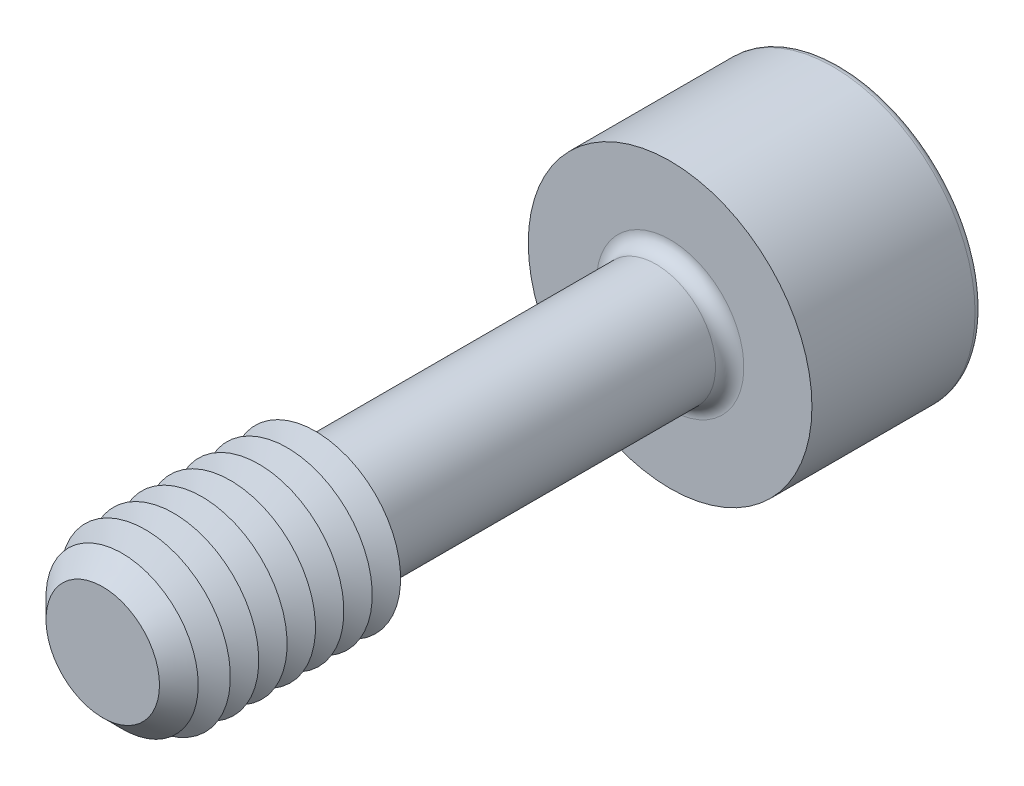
ISO-10303-21;
HEADER;
FILE_DESCRIPTION(('STEP AP214'),'2;1');
FILE_NAME('part.step','',(''),(''),'','','');
FILE_SCHEMA(('AUTOMOTIVE_DESIGN { 1 0 10303 214 1 1 1 1 }'));
ENDSEC;
DATA;
#1=APPLICATION_CONTEXT('core data for automotive mechanical design processes');
#2=APPLICATION_PROTOCOL_DEFINITION('international standard','automotive_design',2000,#1);
#3=PRODUCT_CONTEXT('',#1,'mechanical');
#4=PRODUCT('Part','Part','',(#3));
#5=PRODUCT_RELATED_PRODUCT_CATEGORY('part','',(#4));
#6=PRODUCT_DEFINITION_FORMATION('','',#4);
#7=PRODUCT_DEFINITION_CONTEXT('part definition',#1,'design');
#8=PRODUCT_DEFINITION('design','',#6,#7);
#9=PRODUCT_DEFINITION_SHAPE('','',#8);
#10=(LENGTH_UNIT() NAMED_UNIT(*) SI_UNIT(.MILLI.,.METRE.));
#11=(NAMED_UNIT(*) PLANE_ANGLE_UNIT() SI_UNIT($,.RADIAN.));
#12=(NAMED_UNIT(*) SI_UNIT($,.STERADIAN.) SOLID_ANGLE_UNIT());
#13=UNCERTAINTY_MEASURE_WITH_UNIT(LENGTH_MEASURE(1.E-05),#10,'distance_accuracy_value','');
#14=(GEOMETRIC_REPRESENTATION_CONTEXT(3) GLOBAL_UNCERTAINTY_ASSIGNED_CONTEXT((#13)) GLOBAL_UNIT_ASSIGNED_CONTEXT((#10,
#11,#12)) REPRESENTATION_CONTEXT('',''));
#15=CARTESIAN_POINT('',(0.,0.,0.));
#16=DIRECTION('',(0.,0.,1.));
#17=DIRECTION('',(1.,0.,0.));
#18=AXIS2_PLACEMENT_3D('',#15,#16,#17);
#19=CARTESIAN_POINT('',(-1.44337567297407,-2.5,-11.));
#20=DIRECTION('',(0.,0.,1.));
#21=DIRECTION('',(1.,0.,0.));
#22=AXIS2_PLACEMENT_3D('',#19,#20,#21);
#23=PLANE('',#22);
#24=DIRECTION('',(1.,0.,0.));
#25=VECTOR('',#24,1.);
#26=CARTESIAN_POINT('',(-1.44337567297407,-2.5,-11.));
#27=LINE('',#26,#25);
#28=CARTESIAN_POINT('',(0.,-2.5,-11.));
#29=VERTEX_POINT('',#28);
#30=CARTESIAN_POINT('',(1.44337567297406,-2.5,-11.));
#31=VERTEX_POINT('',#30);
#32=EDGE_CURVE('E729',#29,#31,#27,.T.);
#33=ORIENTED_EDGE('',*,*,#32,.F.);
#34=CARTESIAN_POINT('',(0.,0.,-11.));
#35=DIRECTION('',(0.,0.,1.));
#36=DIRECTION('',(0.,-1.,0.));
#37=AXIS2_PLACEMENT_3D('',#34,#35,#36);
#38=CIRCLE('',#37,2.5);
#39=CARTESIAN_POINT('',(2.1650635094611,-1.25,-11.));
#40=VERTEX_POINT('',#39);
#41=EDGE_CURVE('E53',#29,#40,#38,.T.);
#42=ORIENTED_EDGE('',*,*,#41,.T.);
#43=DIRECTION('',(0.5,0.866025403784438,0.));
#44=VECTOR('',#43,1.);
#45=CARTESIAN_POINT('',(1.44337567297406,-2.5,-11.));
#46=LINE('',#45,#44);
#47=EDGE_CURVE('E715',#31,#40,#46,.T.);
#48=ORIENTED_EDGE('',*,*,#47,.F.);
#49=EDGE_LOOP('',(#33,#42,#48));
#50=FACE_BOUND('',#49,.T.);
#51=ADVANCED_FACE('F41',(#50),#23,.F.);
#52=CARTESIAN_POINT('',(2.88675134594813,0.,-11.));
#53=VERTEX_POINT('',#52);
#54=EDGE_CURVE('E726',#40,#53,#46,.T.);
#55=ORIENTED_EDGE('',*,*,#54,.F.);
#56=CARTESIAN_POINT('',(2.1650635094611,1.25,-11.));
#57=VERTEX_POINT('',#56);
#58=EDGE_CURVE('E11',#40,#57,#38,.T.);
#59=ORIENTED_EDGE('',*,*,#58,.T.);
#60=DIRECTION('',(-0.5,0.866025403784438,0.));
#61=VECTOR('',#60,1.);
#62=CARTESIAN_POINT('',(2.88675134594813,0.,-11.));
#63=LINE('',#62,#61);
#64=EDGE_CURVE('E714',#53,#57,#63,.T.);
#65=ORIENTED_EDGE('',*,*,#64,.F.);
#66=EDGE_LOOP('',(#55,#59,#65));
#67=FACE_BOUND('',#66,.T.);
#68=ADVANCED_FACE('F133',(#67),#23,.F.);
#69=CARTESIAN_POINT('',(1.44337567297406,2.5,-11.));
#70=VERTEX_POINT('',#69);
#71=EDGE_CURVE('E709',#57,#70,#63,.T.);
#72=ORIENTED_EDGE('',*,*,#71,.F.);
#73=CARTESIAN_POINT('',(0.,2.5,-11.));
#74=VERTEX_POINT('',#73);
#75=EDGE_CURVE('E51',#57,#74,#38,.T.);
#76=ORIENTED_EDGE('',*,*,#75,.T.);
#77=DIRECTION('',(-1.,0.,0.));
#78=VECTOR('',#77,1.);
#79=CARTESIAN_POINT('',(1.44337567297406,2.5,-11.));
#80=LINE('',#79,#78);
#81=EDGE_CURVE('E177',#70,#74,#80,.T.);
#82=ORIENTED_EDGE('',*,*,#81,.F.);
#83=EDGE_LOOP('',(#72,#76,#82));
#84=FACE_BOUND('',#83,.T.);
#85=ADVANCED_FACE('F139',(#84),#23,.F.);
#86=CARTESIAN_POINT('',(-1.44337567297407,2.5,-11.));
#87=VERTEX_POINT('',#86);
#88=EDGE_CURVE('E720',#74,#87,#80,.T.);
#89=ORIENTED_EDGE('',*,*,#88,.F.);
#90=CARTESIAN_POINT('',(-2.1650635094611,1.25,-11.));
#91=VERTEX_POINT('',#90);
#92=EDGE_CURVE('E265',#74,#91,#38,.T.);
#93=ORIENTED_EDGE('',*,*,#92,.T.);
#94=DIRECTION('',(-0.5,-0.866025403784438,0.));
#95=VECTOR('',#94,1.);
#96=CARTESIAN_POINT('',(-1.44337567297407,2.5,-11.));
#97=LINE('',#96,#95);
#98=EDGE_CURVE('E176',#87,#91,#97,.T.);
#99=ORIENTED_EDGE('',*,*,#98,.F.);
#100=EDGE_LOOP('',(#89,#93,#99));
#101=FACE_BOUND('',#100,.T.);
#102=ADVANCED_FACE('F157',(#101),#23,.F.);
#103=CARTESIAN_POINT('',(-2.88675134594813,0.,-11.));
#104=VERTEX_POINT('',#103);
#105=EDGE_CURVE('E170',#91,#104,#97,.T.);
#106=ORIENTED_EDGE('',*,*,#105,.F.);
#107=CARTESIAN_POINT('',(-2.1650635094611,-1.25,-11.));
#108=VERTEX_POINT('',#107);
#109=EDGE_CURVE('E172',#91,#108,#38,.T.);
#110=ORIENTED_EDGE('',*,*,#109,.T.);
#111=DIRECTION('',(0.5,-0.866025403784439,0.));
#112=VECTOR('',#111,1.);
#113=CARTESIAN_POINT('',(-2.88675134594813,0.,-11.));
#114=LINE('',#113,#112);
#115=EDGE_CURVE('E174',#104,#108,#114,.T.);
#116=ORIENTED_EDGE('',*,*,#115,.F.);
#117=EDGE_LOOP('',(#106,#110,#116));
#118=FACE_BOUND('',#117,.T.);
#119=ADVANCED_FACE('F146',(#118),#23,.F.);
#120=CARTESIAN_POINT('',(0.,0.,-16.));
#121=DIRECTION('',(0.,0.,-1.));
#122=DIRECTION('',(-1.,0.,0.));
#123=AXIS2_PLACEMENT_3D('',#120,#121,#122);
#124=PLANE('',#123);
#125=CARTESIAN_POINT('',(0.,0.,-16.));
#126=DIRECTION('',(0.,0.,-1.));
#127=DIRECTION('',(-1.,0.,0.));
#128=AXIS2_PLACEMENT_3D('',#125,#126,#127);
#129=CIRCLE('',#128,4.75);
#130=CARTESIAN_POINT('',(-4.75,0.,-16.));
#131=VERTEX_POINT('',#130);
#132=EDGE_CURVE('E251',#131,#131,#129,.T.);
#133=ORIENTED_EDGE('',*,*,#132,.T.);
#134=EDGE_LOOP('',(#133));
#135=FACE_BOUND('',#134,.T.);
#136=DIRECTION('',(-0.5,-0.866025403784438,0.));
#137=VECTOR('',#136,1.);
#138=CARTESIAN_POINT('',(-1.44337567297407,2.5,-16.));
#139=LINE('',#138,#137);
#140=CARTESIAN_POINT('',(-1.44337567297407,2.5,-16.));
#141=VERTEX_POINT('',#140);
#142=CARTESIAN_POINT('',(-2.88675134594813,0.,-16.));
#143=VERTEX_POINT('',#142);
#144=EDGE_CURVE('E212',#141,#143,#139,.T.);
#145=ORIENTED_EDGE('',*,*,#144,.T.);
#146=DIRECTION('',(0.5,-0.866025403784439,0.));
#147=VECTOR('',#146,1.);
#148=CARTESIAN_POINT('',(-2.88675134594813,0.,-16.));
#149=LINE('',#148,#147);
#150=CARTESIAN_POINT('',(-1.44337567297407,-2.5,-16.));
#151=VERTEX_POINT('',#150);
#152=EDGE_CURVE('E67',#143,#151,#149,.T.);
#153=ORIENTED_EDGE('',*,*,#152,.T.);
#154=DIRECTION('',(1.,0.,0.));
#155=VECTOR('',#154,1.);
#156=CARTESIAN_POINT('',(-1.44337567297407,-2.5,-16.));
#157=LINE('',#156,#155);
#158=CARTESIAN_POINT('',(1.44337567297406,-2.5,-16.));
#159=VERTEX_POINT('',#158);
#160=EDGE_CURVE('E196',#151,#159,#157,.T.);
#161=ORIENTED_EDGE('',*,*,#160,.T.);
#162=DIRECTION('',(0.5,0.866025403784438,0.));
#163=VECTOR('',#162,1.);
#164=CARTESIAN_POINT('',(1.44337567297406,-2.5,-16.));
#165=LINE('',#164,#163);
#166=CARTESIAN_POINT('',(2.88675134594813,0.,-16.));
#167=VERTEX_POINT('',#166);
#168=EDGE_CURVE('E200',#159,#167,#165,.T.);
#169=ORIENTED_EDGE('',*,*,#168,.T.);
#170=DIRECTION('',(-0.5,0.866025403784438,0.));
#171=VECTOR('',#170,1.);
#172=CARTESIAN_POINT('',(2.88675134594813,0.,-16.));
#173=LINE('',#172,#171);
#174=CARTESIAN_POINT('',(1.44337567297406,2.5,-16.));
#175=VERTEX_POINT('',#174);
#176=EDGE_CURVE('E204',#167,#175,#173,.T.);
#177=ORIENTED_EDGE('',*,*,#176,.T.);
#178=DIRECTION('',(-1.,0.,0.));
#179=VECTOR('',#178,1.);
#180=CARTESIAN_POINT('',(1.44337567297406,2.5,-16.));
#181=LINE('',#180,#179);
#182=EDGE_CURVE('E208',#175,#141,#181,.T.);
#183=ORIENTED_EDGE('',*,*,#182,.T.);
#184=EDGE_LOOP('',(#145,#153,#161,#169,#177,#183));
#185=FACE_BOUND('',#184,.T.);
#186=ADVANCED_FACE('F156',(#135,#185),#124,.T.);
#187=CARTESIAN_POINT('',(0.,0.,10.));
#188=DIRECTION('',(0.,0.,-1.));
#189=DIRECTION('',(-1.,0.,0.));
#190=AXIS2_PLACEMENT_3D('',#187,#188,#189);
#191=CYLINDRICAL_SURFACE('',#190,2.1);
#192=CARTESIAN_POINT('',(0.,0.,-9.5));
#193=DIRECTION('',(0.,0.,-1.));
#194=DIRECTION('',(-1.,0.,0.));
#195=AXIS2_PLACEMENT_3D('',#192,#193,#194);
#196=CIRCLE('',#195,2.1);
#197=CARTESIAN_POINT('',(-2.1,0.,-9.5));
#198=VERTEX_POINT('',#197);
#199=EDGE_CURVE('E247',#198,#198,#196,.F.);
#200=ORIENTED_EDGE('',*,*,#199,.T.);
#201=EDGE_LOOP('',(#200));
#202=FACE_BOUND('',#201,.T.);
#203=CARTESIAN_POINT('',(0.,0.,1.98038475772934));
#204=DIRECTION('',(0.,0.,-1.));
#205=DIRECTION('',(0.,1.,0.));
#206=AXIS2_PLACEMENT_3D('',#203,#204,#205);
#207=CIRCLE('',#206,2.1);
#208=CARTESIAN_POINT('',(0.,2.1,1.98038475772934));
#209=VERTEX_POINT('',#208);
#210=EDGE_CURVE('E235',#209,#209,#207,.T.);
#211=ORIENTED_EDGE('',*,*,#210,.T.);
#212=EDGE_LOOP('',(#211));
#213=FACE_BOUND('',#212,.T.);
#214=ADVANCED_FACE('F163',(#202,#213),#191,.T.);
#215=CARTESIAN_POINT('',(0.,0.,1.98038475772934));
#216=DIRECTION('',(0.,0.,1.));
#217=DIRECTION('',(0.,-1.,0.));
#218=AXIS2_PLACEMENT_3D('',#215,#216,#217);
#219=CONICAL_SURFACE('',#218,2.1,1.0471975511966);
#220=CARTESIAN_POINT('',(0.,0.,2.5));
#221=DIRECTION('',(0.,0.,-1.));
#222=DIRECTION('',(-1.,0.,0.));
#223=AXIS2_PLACEMENT_3D('',#220,#221,#222);
#224=CIRCLE('',#223,3.);
#225=CARTESIAN_POINT('',(-3.,0.,2.5));
#226=VERTEX_POINT('',#225);
#227=EDGE_CURVE('E269',#226,#226,#224,.T.);
#228=ORIENTED_EDGE('',*,*,#227,.T.);
#229=EDGE_LOOP('',(#228));
#230=FACE_BOUND('',#229,.T.);
#231=ORIENTED_EDGE('',*,*,#210,.F.);
#232=EDGE_LOOP('',(#231));
#233=FACE_BOUND('',#232,.T.);
#234=ADVANCED_FACE('F486',(#230,#233),#219,.T.);
#235=CARTESIAN_POINT('',(0.,0.,-10.));
#236=DIRECTION('',(0.,0.,-1.));
#237=DIRECTION('',(-1.,0.,0.));
#238=AXIS2_PLACEMENT_3D('',#235,#236,#237);
#239=PLANE('',#238);
#240=CARTESIAN_POINT('',(0.,0.,-10.));
#241=DIRECTION('',(0.,0.,-1.));
#242=DIRECTION('',(-1.,0.,0.));
#243=AXIS2_PLACEMENT_3D('',#240,#241,#242);
#244=CIRCLE('',#243,2.6);
#245=CARTESIAN_POINT('',(-2.6,0.,-10.));
#246=VERTEX_POINT('',#245);
#247=EDGE_CURVE('E243',#246,#246,#244,.T.);
#248=ORIENTED_EDGE('',*,*,#247,.T.);
#249=EDGE_LOOP('',(#248));
#250=FACE_BOUND('',#249,.T.);
#251=CARTESIAN_POINT('',(0.,0.,-10.));
#252=DIRECTION('',(0.,0.,-1.));
#253=DIRECTION('',(-1.,0.,0.));
#254=AXIS2_PLACEMENT_3D('',#251,#252,#253);
#255=CIRCLE('',#254,5.);
#256=CARTESIAN_POINT('',(-5.,0.,-10.));
#257=VERTEX_POINT('',#256);
#258=EDGE_CURVE('E231',#257,#257,#255,.T.);
#259=ORIENTED_EDGE('',*,*,#258,.F.);
#260=EDGE_LOOP('',(#259));
#261=FACE_BOUND('',#260,.T.);
#262=ADVANCED_FACE('F479',(#250,#261),#239,.F.);
#263=CARTESIAN_POINT('',(0.,0.,-16.));
#264=DIRECTION('',(0.,0.,1.));
#265=DIRECTION('',(1.,0.,0.));
#266=AXIS2_PLACEMENT_3D('',#263,#264,#265);
#267=CYLINDRICAL_SURFACE('',#266,5.);
#268=CARTESIAN_POINT('',(0.,0.,-15.75));
#269=DIRECTION('',(0.,0.,-1.));
#270=DIRECTION('',(-1.,0.,0.));
#271=AXIS2_PLACEMENT_3D('',#268,#269,#270);
#272=CIRCLE('',#271,5.);
#273=CARTESIAN_POINT('',(-5.,0.,-15.75));
#274=VERTEX_POINT('',#273);
#275=EDGE_CURVE('E254',#274,#274,#272,.F.);
#276=ORIENTED_EDGE('',*,*,#275,.T.);
#277=EDGE_LOOP('',(#276));
#278=FACE_BOUND('',#277,.T.);
#279=ORIENTED_EDGE('',*,*,#258,.T.);
#280=EDGE_LOOP('',(#279));
#281=FACE_BOUND('',#280,.T.);
#282=ADVANCED_FACE('F485',(#278,#281),#267,.T.);
#283=CARTESIAN_POINT('',(-2.88675134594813,0.,-11.));
#284=DIRECTION('',(0.866025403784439,0.5,0.));
#285=DIRECTION('',(-0.5,0.866025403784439,0.));
#286=AXIS2_PLACEMENT_3D('',#283,#284,#285);
#287=PLANE('',#286);
#288=ORIENTED_EDGE('',*,*,#152,.F.);
#289=DIRECTION('',(0.,0.,-1.));
#290=VECTOR('',#289,1.);
#291=CARTESIAN_POINT('',(-2.88675134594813,0.,-11.));
#292=LINE('',#291,#290);
#293=EDGE_CURVE('E186',#104,#143,#292,.T.);
#294=ORIENTED_EDGE('',*,*,#293,.F.);
#295=ORIENTED_EDGE('',*,*,#115,.T.);
#296=CARTESIAN_POINT('',(-1.44337567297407,-2.5,-11.));
#297=VERTEX_POINT('',#296);
#298=EDGE_CURVE('E215',#108,#297,#114,.T.);
#299=ORIENTED_EDGE('',*,*,#298,.T.);
#300=DIRECTION('',(0.,0.,-1.));
#301=VECTOR('',#300,1.);
#302=CARTESIAN_POINT('',(-1.44337567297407,-2.5,-11.));
#303=LINE('',#302,#301);
#304=EDGE_CURVE('E228',#297,#151,#303,.T.);
#305=ORIENTED_EDGE('',*,*,#304,.T.);
#306=EDGE_LOOP('',(#288,#294,#295,#299,#305));
#307=FACE_BOUND('',#306,.T.);
#308=ADVANCED_FACE('F497',(#307),#287,.T.);
#309=CARTESIAN_POINT('',(-1.44337567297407,-2.5,-11.));
#310=DIRECTION('',(0.,1.,0.));
#311=DIRECTION('',(-1.,0.,0.));
#312=AXIS2_PLACEMENT_3D('',#309,#310,#311);
#313=PLANE('',#312);
#314=ORIENTED_EDGE('',*,*,#160,.F.);
#315=ORIENTED_EDGE('',*,*,#304,.F.);
#316=EDGE_CURVE('E727',#297,#29,#27,.T.);
#317=ORIENTED_EDGE('',*,*,#316,.T.);
#318=ORIENTED_EDGE('',*,*,#32,.T.);
#319=DIRECTION('',(0.,0.,-1.));
#320=VECTOR('',#319,1.);
#321=CARTESIAN_POINT('',(1.44337567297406,-2.5,-11.));
#322=LINE('',#321,#320);
#323=EDGE_CURVE('E225',#31,#159,#322,.T.);
#324=ORIENTED_EDGE('',*,*,#323,.T.);
#325=EDGE_LOOP('',(#314,#315,#317,#318,#324));
#326=FACE_BOUND('',#325,.T.);
#327=ADVANCED_FACE('F513',(#326),#313,.T.);
#328=CARTESIAN_POINT('',(1.44337567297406,-2.5,-11.));
#329=DIRECTION('',(-0.866025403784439,0.5,0.));
#330=DIRECTION('',(-0.5,-0.866025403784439,0.));
#331=AXIS2_PLACEMENT_3D('',#328,#329,#330);
#332=PLANE('',#331);
#333=ORIENTED_EDGE('',*,*,#168,.F.);
#334=ORIENTED_EDGE('',*,*,#323,.F.);
#335=ORIENTED_EDGE('',*,*,#47,.T.);
#336=ORIENTED_EDGE('',*,*,#54,.T.);
#337=DIRECTION('',(0.,0.,-1.));
#338=VECTOR('',#337,1.);
#339=CARTESIAN_POINT('',(2.88675134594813,0.,-11.));
#340=LINE('',#339,#338);
#341=EDGE_CURVE('E222',#53,#167,#340,.T.);
#342=ORIENTED_EDGE('',*,*,#341,.T.);
#343=EDGE_LOOP('',(#333,#334,#335,#336,#342));
#344=FACE_BOUND('',#343,.T.);
#345=ADVANCED_FACE('F523',(#344),#332,.T.);
#346=CARTESIAN_POINT('',(2.88675134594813,0.,-11.));
#347=DIRECTION('',(-0.866025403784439,-0.5,0.));
#348=DIRECTION('',(0.5,-0.866025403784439,0.));
#349=AXIS2_PLACEMENT_3D('',#346,#347,#348);
#350=PLANE('',#349);
#351=ORIENTED_EDGE('',*,*,#176,.F.);
#352=ORIENTED_EDGE('',*,*,#341,.F.);
#353=ORIENTED_EDGE('',*,*,#64,.T.);
#354=ORIENTED_EDGE('',*,*,#71,.T.);
#355=DIRECTION('',(0.,0.,-1.));
#356=VECTOR('',#355,1.);
#357=CARTESIAN_POINT('',(1.44337567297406,2.5,-11.));
#358=LINE('',#357,#356);
#359=EDGE_CURVE('E219',#70,#175,#358,.T.);
#360=ORIENTED_EDGE('',*,*,#359,.T.);
#361=EDGE_LOOP('',(#351,#352,#353,#354,#360));
#362=FACE_BOUND('',#361,.T.);
#363=ADVANCED_FACE('F533',(#362),#350,.T.);
#364=CARTESIAN_POINT('',(1.44337567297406,2.5,-11.));
#365=DIRECTION('',(0.,-1.,0.));
#366=DIRECTION('',(0.,0.,-1.));
#367=AXIS2_PLACEMENT_3D('',#364,#365,#366);
#368=PLANE('',#367);
#369=ORIENTED_EDGE('',*,*,#182,.F.);
#370=ORIENTED_EDGE('',*,*,#359,.F.);
#371=ORIENTED_EDGE('',*,*,#81,.T.);
#372=ORIENTED_EDGE('',*,*,#88,.T.);
#373=DIRECTION('',(0.,0.,-1.));
#374=VECTOR('',#373,1.);
#375=CARTESIAN_POINT('',(-1.44337567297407,2.5,-11.));
#376=LINE('',#375,#374);
#377=EDGE_CURVE('E182',#87,#141,#376,.T.);
#378=ORIENTED_EDGE('',*,*,#377,.T.);
#379=EDGE_LOOP('',(#369,#370,#371,#372,#378));
#380=FACE_BOUND('',#379,.T.);
#381=ADVANCED_FACE('F152',(#380),#368,.T.);
#382=CARTESIAN_POINT('',(-1.44337567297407,2.5,-11.));
#383=DIRECTION('',(0.866025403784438,-0.5,0.));
#384=DIRECTION('',(0.5,0.866025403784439,0.));
#385=AXIS2_PLACEMENT_3D('',#382,#383,#384);
#386=PLANE('',#385);
#387=ORIENTED_EDGE('',*,*,#144,.F.);
#388=ORIENTED_EDGE('',*,*,#377,.F.);
#389=ORIENTED_EDGE('',*,*,#98,.T.);
#390=ORIENTED_EDGE('',*,*,#105,.T.);
#391=ORIENTED_EDGE('',*,*,#293,.T.);
#392=EDGE_LOOP('',(#387,#388,#389,#390,#391));
#393=FACE_BOUND('',#392,.T.);
#394=ADVANCED_FACE('F144',(#393),#386,.T.);
#395=ORIENTED_EDGE('',*,*,#298,.F.);
#396=EDGE_CURVE('E257',#108,#29,#38,.T.);
#397=ORIENTED_EDGE('',*,*,#396,.T.);
#398=ORIENTED_EDGE('',*,*,#316,.F.);
#399=EDGE_LOOP('',(#395,#397,#398));
#400=FACE_BOUND('',#399,.T.);
#401=ADVANCED_FACE('F135',(#400),#23,.F.);
#402=CARTESIAN_POINT('',(0.,0.,-9.5));
#403=DIRECTION('',(0.,0.,-1.));
#404=DIRECTION('',(-1.,0.,0.));
#405=AXIS2_PLACEMENT_3D('',#402,#403,#404);
#406=TOROIDAL_SURFACE('',#405,2.6,0.5);
#407=ORIENTED_EDGE('',*,*,#199,.F.);
#408=EDGE_LOOP('',(#407));
#409=FACE_BOUND('',#408,.T.);
#410=ORIENTED_EDGE('',*,*,#247,.F.);
#411=EDGE_LOOP('',(#410));
#412=FACE_BOUND('',#411,.T.);
#413=ADVANCED_FACE('F129',(#409,#412),#406,.F.);
#414=CARTESIAN_POINT('',(0.,0.,-15.75));
#415=DIRECTION('',(0.,0.,-1.));
#416=DIRECTION('',(-1.,0.,0.));
#417=AXIS2_PLACEMENT_3D('',#414,#415,#416);
#418=TOROIDAL_SURFACE('',#417,4.75,0.25);
#419=ORIENTED_EDGE('',*,*,#275,.F.);
#420=EDGE_LOOP('',(#419));
#421=FACE_BOUND('',#420,.T.);
#422=ORIENTED_EDGE('',*,*,#132,.F.);
#423=EDGE_LOOP('',(#422));
#424=FACE_BOUND('',#423,.T.);
#425=ADVANCED_FACE('F43',(#421,#424),#418,.T.);
#426=CARTESIAN_POINT('',(0.,0.,-9.55662432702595));
#427=DIRECTION('',(0.,0.,-1.));
#428=DIRECTION('',(0.,1.,0.));
#429=AXIS2_PLACEMENT_3D('',#426,#427,#428);
#430=CONICAL_SURFACE('',#429,0.,1.0471975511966);
#431=ORIENTED_EDGE('',*,*,#41,.F.);
#432=ORIENTED_EDGE('',*,*,#396,.F.);
#433=ORIENTED_EDGE('',*,*,#109,.F.);
#434=ORIENTED_EDGE('',*,*,#92,.F.);
#435=ORIENTED_EDGE('',*,*,#75,.F.);
#436=ORIENTED_EDGE('',*,*,#58,.F.);
#437=EDGE_LOOP('',(#431,#432,#433,#434,#435,#436));
#438=FACE_BOUND('',#437,.T.);
#439=CARTESIAN_POINT('',(0.,0.,-9.55662432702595));
#440=VERTEX_POINT('',#439);
#441=VERTEX_LOOP('',#440);
#442=FACE_BOUND('',#441,.T.);
#443=ADVANCED_FACE('F118',(#438,#442),#430,.F.);
#444=CARTESIAN_POINT('',(0.,0.,3.));
#445=DIRECTION('',(0.,0.,-1.));
#446=DIRECTION('',(-1.,0.,0.));
#447=AXIS2_PLACEMENT_3D('',#444,#445,#446);
#448=CONICAL_SURFACE('',#447,2.13397459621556,1.0471975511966);
#449=ORIENTED_EDGE('',*,*,#227,.F.);
#450=EDGE_LOOP('',(#449));
#451=FACE_BOUND('',#450,.T.);
#452=CARTESIAN_POINT('',(0.,0.,3.));
#453=DIRECTION('',(0.,0.,-1.));
#454=DIRECTION('',(-1.,0.,0.));
#455=AXIS2_PLACEMENT_3D('',#452,#453,#454);
#456=CIRCLE('',#455,2.13397459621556);
#457=CARTESIAN_POINT('',(-2.13397459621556,0.,3.));
#458=VERTEX_POINT('',#457);
#459=EDGE_CURVE('E276',#458,#458,#456,.T.);
#460=ORIENTED_EDGE('',*,*,#459,.T.);
#461=EDGE_LOOP('',(#460));
#462=FACE_BOUND('',#461,.T.);
#463=ADVANCED_FACE('F120',(#451,#462),#448,.T.);
#464=CARTESIAN_POINT('',(0.,0.,3.5));
#465=DIRECTION('',(0.,0.,1.));
#466=DIRECTION('',(1.,0.,0.));
#467=AXIS2_PLACEMENT_3D('',#464,#465,#466);
#468=CONICAL_SURFACE('',#467,3.,1.0471975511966);
#469=ORIENTED_EDGE('',*,*,#459,.F.);
#470=EDGE_LOOP('',(#469));
#471=FACE_BOUND('',#470,.T.);
#472=CARTESIAN_POINT('',(0.,0.,3.5));
#473=DIRECTION('',(0.,0.,-1.));
#474=DIRECTION('',(-1.,0.,0.));
#475=AXIS2_PLACEMENT_3D('',#472,#473,#474);
#476=CIRCLE('',#475,3.);
#477=CARTESIAN_POINT('',(-3.,0.,3.5));
#478=VERTEX_POINT('',#477);
#479=EDGE_CURVE('E282',#478,#478,#476,.T.);
#480=ORIENTED_EDGE('',*,*,#479,.T.);
#481=EDGE_LOOP('',(#480));
#482=FACE_BOUND('',#481,.T.);
#483=ADVANCED_FACE('F126',(#471,#482),#468,.T.);
#484=CARTESIAN_POINT('',(0.,0.,4.));
#485=DIRECTION('',(0.,0.,-1.));
#486=DIRECTION('',(-1.,0.,0.));
#487=AXIS2_PLACEMENT_3D('',#484,#485,#486);
#488=CONICAL_SURFACE('',#487,2.13397459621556,1.0471975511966);
#489=ORIENTED_EDGE('',*,*,#479,.F.);
#490=EDGE_LOOP('',(#489));
#491=FACE_BOUND('',#490,.T.);
#492=CARTESIAN_POINT('',(0.,0.,4.));
#493=DIRECTION('',(0.,0.,-1.));
#494=DIRECTION('',(-1.,0.,0.));
#495=AXIS2_PLACEMENT_3D('',#492,#493,#494);
#496=CIRCLE('',#495,2.13397459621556);
#497=CARTESIAN_POINT('',(-2.13397459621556,0.,4.));
#498=VERTEX_POINT('',#497);
#499=EDGE_CURVE('E288',#498,#498,#496,.T.);
#500=ORIENTED_EDGE('',*,*,#499,.T.);
#501=EDGE_LOOP('',(#500));
#502=FACE_BOUND('',#501,.T.);
#503=ADVANCED_FACE('F383',(#491,#502),#488,.T.);
#504=CARTESIAN_POINT('',(0.,0.,4.5));
#505=DIRECTION('',(0.,0.,1.));
#506=DIRECTION('',(1.,0.,0.));
#507=AXIS2_PLACEMENT_3D('',#504,#505,#506);
#508=CONICAL_SURFACE('',#507,3.,1.0471975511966);
#509=ORIENTED_EDGE('',*,*,#499,.F.);
#510=EDGE_LOOP('',(#509));
#511=FACE_BOUND('',#510,.T.);
#512=CARTESIAN_POINT('',(0.,0.,4.5));
#513=DIRECTION('',(0.,0.,-1.));
#514=DIRECTION('',(-1.,0.,0.));
#515=AXIS2_PLACEMENT_3D('',#512,#513,#514);
#516=CIRCLE('',#515,3.);
#517=CARTESIAN_POINT('',(-3.,0.,4.5));
#518=VERTEX_POINT('',#517);
#519=EDGE_CURVE('E292',#518,#518,#516,.T.);
#520=ORIENTED_EDGE('',*,*,#519,.T.);
#521=EDGE_LOOP('',(#520));
#522=FACE_BOUND('',#521,.T.);
#523=ADVANCED_FACE('F379',(#511,#522),#508,.T.);
#524=CARTESIAN_POINT('',(0.,0.,5.));
#525=DIRECTION('',(0.,0.,-1.));
#526=DIRECTION('',(-1.,0.,0.));
#527=AXIS2_PLACEMENT_3D('',#524,#525,#526);
#528=CONICAL_SURFACE('',#527,2.13397459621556,1.0471975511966);
#529=ORIENTED_EDGE('',*,*,#519,.F.);
#530=EDGE_LOOP('',(#529));
#531=FACE_BOUND('',#530,.T.);
#532=CARTESIAN_POINT('',(0.,0.,5.));
#533=DIRECTION('',(0.,0.,-1.));
#534=DIRECTION('',(-1.,0.,0.));
#535=AXIS2_PLACEMENT_3D('',#532,#533,#534);
#536=CIRCLE('',#535,2.13397459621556);
#537=CARTESIAN_POINT('',(-2.13397459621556,0.,5.));
#538=VERTEX_POINT('',#537);
#539=EDGE_CURVE('E296',#538,#538,#536,.T.);
#540=ORIENTED_EDGE('',*,*,#539,.T.);
#541=EDGE_LOOP('',(#540));
#542=FACE_BOUND('',#541,.T.);
#543=ADVANCED_FACE('F375',(#531,#542),#528,.T.);
#544=CARTESIAN_POINT('',(0.,0.,5.5));
#545=DIRECTION('',(0.,0.,1.));
#546=DIRECTION('',(1.,0.,0.));
#547=AXIS2_PLACEMENT_3D('',#544,#545,#546);
#548=CONICAL_SURFACE('',#547,3.,1.0471975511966);
#549=ORIENTED_EDGE('',*,*,#539,.F.);
#550=EDGE_LOOP('',(#549));
#551=FACE_BOUND('',#550,.T.);
#552=CARTESIAN_POINT('',(0.,0.,5.5));
#553=DIRECTION('',(0.,0.,-1.));
#554=DIRECTION('',(-1.,0.,0.));
#555=AXIS2_PLACEMENT_3D('',#552,#553,#554);
#556=CIRCLE('',#555,3.);
#557=CARTESIAN_POINT('',(-3.,0.,5.5));
#558=VERTEX_POINT('',#557);
#559=EDGE_CURVE('E299',#558,#558,#556,.T.);
#560=ORIENTED_EDGE('',*,*,#559,.T.);
#561=EDGE_LOOP('',(#560));
#562=FACE_BOUND('',#561,.T.);
#563=ADVANCED_FACE('F371',(#551,#562),#548,.T.);
#564=CARTESIAN_POINT('',(0.,0.,6.));
#565=DIRECTION('',(0.,0.,-1.));
#566=DIRECTION('',(-1.,0.,0.));
#567=AXIS2_PLACEMENT_3D('',#564,#565,#566);
#568=CONICAL_SURFACE('',#567,2.13397459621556,1.0471975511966);
#569=ORIENTED_EDGE('',*,*,#559,.F.);
#570=EDGE_LOOP('',(#569));
#571=FACE_BOUND('',#570,.T.);
#572=CARTESIAN_POINT('',(0.,0.,6.));
#573=DIRECTION('',(0.,0.,-1.));
#574=DIRECTION('',(-1.,0.,0.));
#575=AXIS2_PLACEMENT_3D('',#572,#573,#574);
#576=CIRCLE('',#575,2.13397459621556);
#577=CARTESIAN_POINT('',(-2.13397459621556,0.,6.));
#578=VERTEX_POINT('',#577);
#579=EDGE_CURVE('E302',#578,#578,#576,.T.);
#580=ORIENTED_EDGE('',*,*,#579,.T.);
#581=EDGE_LOOP('',(#580));
#582=FACE_BOUND('',#581,.T.);
#583=ADVANCED_FACE('F367',(#571,#582),#568,.T.);
#584=CARTESIAN_POINT('',(0.,0.,6.5));
#585=DIRECTION('',(0.,0.,1.));
#586=DIRECTION('',(1.,0.,0.));
#587=AXIS2_PLACEMENT_3D('',#584,#585,#586);
#588=CONICAL_SURFACE('',#587,3.,1.0471975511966);
#589=ORIENTED_EDGE('',*,*,#579,.F.);
#590=EDGE_LOOP('',(#589));
#591=FACE_BOUND('',#590,.T.);
#592=CARTESIAN_POINT('',(0.,0.,6.5));
#593=DIRECTION('',(0.,0.,-1.));
#594=DIRECTION('',(-1.,0.,0.));
#595=AXIS2_PLACEMENT_3D('',#592,#593,#594);
#596=CIRCLE('',#595,3.);
#597=CARTESIAN_POINT('',(-3.,0.,6.5));
#598=VERTEX_POINT('',#597);
#599=EDGE_CURVE('E305',#598,#598,#596,.T.);
#600=ORIENTED_EDGE('',*,*,#599,.T.);
#601=EDGE_LOOP('',(#600));
#602=FACE_BOUND('',#601,.T.);
#603=ADVANCED_FACE('F363',(#591,#602),#588,.T.);
#604=CARTESIAN_POINT('',(0.,0.,7.));
#605=DIRECTION('',(0.,0.,-1.));
#606=DIRECTION('',(-1.,0.,0.));
#607=AXIS2_PLACEMENT_3D('',#604,#605,#606);
#608=CONICAL_SURFACE('',#607,2.13397459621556,1.0471975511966);
#609=ORIENTED_EDGE('',*,*,#599,.F.);
#610=EDGE_LOOP('',(#609));
#611=FACE_BOUND('',#610,.T.);
#612=CARTESIAN_POINT('',(0.,0.,7.));
#613=DIRECTION('',(0.,0.,-1.));
#614=DIRECTION('',(-1.,0.,0.));
#615=AXIS2_PLACEMENT_3D('',#612,#613,#614);
#616=CIRCLE('',#615,2.13397459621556);
#617=CARTESIAN_POINT('',(-2.13397459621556,0.,7.));
#618=VERTEX_POINT('',#617);
#619=EDGE_CURVE('E309',#618,#618,#616,.T.);
#620=ORIENTED_EDGE('',*,*,#619,.T.);
#621=EDGE_LOOP('',(#620));
#622=FACE_BOUND('',#621,.T.);
#623=ADVANCED_FACE('F359',(#611,#622),#608,.T.);
#624=CARTESIAN_POINT('',(0.,0.,7.5));
#625=DIRECTION('',(0.,0.,1.));
#626=DIRECTION('',(1.,0.,0.));
#627=AXIS2_PLACEMENT_3D('',#624,#625,#626);
#628=CONICAL_SURFACE('',#627,3.,1.0471975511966);
#629=ORIENTED_EDGE('',*,*,#619,.F.);
#630=EDGE_LOOP('',(#629));
#631=FACE_BOUND('',#630,.T.);
#632=CARTESIAN_POINT('',(0.,0.,7.5));
#633=DIRECTION('',(0.,0.,-1.));
#634=DIRECTION('',(-1.,0.,0.));
#635=AXIS2_PLACEMENT_3D('',#632,#633,#634);
#636=CIRCLE('',#635,3.);
#637=CARTESIAN_POINT('',(-3.,0.,7.5));
#638=VERTEX_POINT('',#637);
#639=EDGE_CURVE('E313',#638,#638,#636,.T.);
#640=ORIENTED_EDGE('',*,*,#639,.T.);
#641=EDGE_LOOP('',(#640));
#642=FACE_BOUND('',#641,.T.);
#643=ADVANCED_FACE('F355',(#631,#642),#628,.T.);
#644=CARTESIAN_POINT('',(0.,0.,8.));
#645=DIRECTION('',(0.,0.,-1.));
#646=DIRECTION('',(-1.,0.,0.));
#647=AXIS2_PLACEMENT_3D('',#644,#645,#646);
#648=CONICAL_SURFACE('',#647,2.13397459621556,1.0471975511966);
#649=ORIENTED_EDGE('',*,*,#639,.F.);
#650=EDGE_LOOP('',(#649));
#651=FACE_BOUND('',#650,.T.);
#652=CARTESIAN_POINT('',(0.,0.,8.));
#653=DIRECTION('',(0.,0.,-1.));
#654=DIRECTION('',(-1.,0.,0.));
#655=AXIS2_PLACEMENT_3D('',#652,#653,#654);
#656=CIRCLE('',#655,2.13397459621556);
#657=CARTESIAN_POINT('',(-2.13397459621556,0.,8.));
#658=VERTEX_POINT('',#657);
#659=EDGE_CURVE('E317',#658,#658,#656,.T.);
#660=ORIENTED_EDGE('',*,*,#659,.T.);
#661=EDGE_LOOP('',(#660));
#662=FACE_BOUND('',#661,.T.);
#663=ADVANCED_FACE('F351',(#651,#662),#648,.T.);
#664=CARTESIAN_POINT('',(0.,0.,8.5));
#665=DIRECTION('',(0.,0.,1.));
#666=DIRECTION('',(1.,0.,0.));
#667=AXIS2_PLACEMENT_3D('',#664,#665,#666);
#668=CONICAL_SURFACE('',#667,3.,1.0471975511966);
#669=ORIENTED_EDGE('',*,*,#659,.F.);
#670=EDGE_LOOP('',(#669));
#671=FACE_BOUND('',#670,.T.);
#672=CARTESIAN_POINT('',(0.,0.,8.5));
#673=DIRECTION('',(0.,0.,-1.));
#674=DIRECTION('',(-1.,0.,0.));
#675=AXIS2_PLACEMENT_3D('',#672,#673,#674);
#676=CIRCLE('',#675,3.);
#677=CARTESIAN_POINT('',(-3.,0.,8.5));
#678=VERTEX_POINT('',#677);
#679=EDGE_CURVE('E321',#678,#678,#676,.T.);
#680=ORIENTED_EDGE('',*,*,#679,.T.);
#681=EDGE_LOOP('',(#680));
#682=FACE_BOUND('',#681,.T.);
#683=ADVANCED_FACE('F344',(#671,#682),#668,.T.);
#684=CARTESIAN_POINT('',(0.,0.,9.));
#685=DIRECTION('',(0.,0.,-1.));
#686=DIRECTION('',(-1.,0.,0.));
#687=AXIS2_PLACEMENT_3D('',#684,#685,#686);
#688=CONICAL_SURFACE('',#687,2.13397459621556,1.0471975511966);
#689=ORIENTED_EDGE('',*,*,#679,.F.);
#690=EDGE_LOOP('',(#689));
#691=FACE_BOUND('',#690,.T.);
#692=CARTESIAN_POINT('',(0.,0.,9.));
#693=DIRECTION('',(0.,0.,-1.));
#694=DIRECTION('',(-1.,0.,0.));
#695=AXIS2_PLACEMENT_3D('',#692,#693,#694);
#696=CIRCLE('',#695,2.13397459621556);
#697=CARTESIAN_POINT('',(-2.13397459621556,0.,9.));
#698=VERTEX_POINT('',#697);
#699=EDGE_CURVE('E324',#698,#698,#696,.T.);
#700=ORIENTED_EDGE('',*,*,#699,.T.);
#701=EDGE_LOOP('',(#700));
#702=FACE_BOUND('',#701,.T.);
#703=ADVANCED_FACE('F330',(#691,#702),#688,.T.);
#704=CARTESIAN_POINT('',(0.,0.,9.5));
#705=DIRECTION('',(0.,0.,1.));
#706=DIRECTION('',(1.,0.,0.));
#707=AXIS2_PLACEMENT_3D('',#704,#705,#706);
#708=CONICAL_SURFACE('',#707,3.,1.0471975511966);
#709=CARTESIAN_POINT('',(0.,0.,9.31698729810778));
#710=DIRECTION('',(0.,0.,1.));
#711=DIRECTION('',(1.,0.,0.));
#712=AXIS2_PLACEMENT_3D('',#709,#710,#711);
#713=CIRCLE('',#712,2.68301270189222);
#714=CARTESIAN_POINT('',(2.68301270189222,0.,9.31698729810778));
#715=VERTEX_POINT('',#714);
#716=EDGE_CURVE('E45',#715,#715,#713,.F.);
#717=ORIENTED_EDGE('',*,*,#716,.T.);
#718=EDGE_LOOP('',(#717));
#719=FACE_BOUND('',#718,.T.);
#720=ORIENTED_EDGE('',*,*,#699,.F.);
#721=EDGE_LOOP('',(#720));
#722=FACE_BOUND('',#721,.T.);
#723=ADVANCED_FACE('F332',(#719,#722),#708,.T.);
#724=CARTESIAN_POINT('',(0.,0.,10.));
#725=DIRECTION('',(0.,0.,1.));
#726=DIRECTION('',(1.,0.,0.));
#727=AXIS2_PLACEMENT_3D('',#724,#725,#726);
#728=PLANE('',#727);
#729=CARTESIAN_POINT('',(0.,0.,10.));
#730=DIRECTION('',(0.,0.,1.));
#731=DIRECTION('',(1.,0.,0.));
#732=AXIS2_PLACEMENT_3D('',#729,#730,#731);
#733=CIRCLE('',#732,1.99999999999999);
#734=CARTESIAN_POINT('',(1.99999999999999,0.,10.));
#735=VERTEX_POINT('',#734);
#736=EDGE_CURVE('E239',#735,#735,#733,.T.);
#737=ORIENTED_EDGE('',*,*,#736,.T.);
#738=EDGE_LOOP('',(#737));
#739=FACE_BOUND('',#738,.T.);
#740=ADVANCED_FACE('F334',(#739),#728,.T.);
#741=CARTESIAN_POINT('',(0.,0.,9.));
#742=DIRECTION('',(0.,0.,-1.));
#743=DIRECTION('',(0.,1.,0.));
#744=AXIS2_PLACEMENT_3D('',#741,#742,#743);
#745=CONICAL_SURFACE('',#744,3.,0.78539816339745);
#746=ORIENTED_EDGE('',*,*,#716,.F.);
#747=EDGE_LOOP('',(#746));
#748=FACE_BOUND('',#747,.T.);
#749=ORIENTED_EDGE('',*,*,#736,.F.);
#750=EDGE_LOOP('',(#749));
#751=FACE_BOUND('',#750,.T.);
#752=ADVANCED_FACE('F341',(#748,#751),#745,.T.);
#753=CLOSED_SHELL('',(#51,#68,#85,#102,#119,#186,#214,#234,#262,#282,#308,#327,#345,#363,#381,
#394,#401,#413,#425,#443,#463,#483,#503,#523,#543,#563,#583,#603,#623,#643,#663,#683,#703,#723,
#740,#752));
#754=MANIFOLD_SOLID_BREP('B2',#753);
#755=ADVANCED_BREP_SHAPE_REPRESENTATION('',(#18,#754),#14);
#756=SHAPE_DEFINITION_REPRESENTATION(#9,#755);
ENDSEC;
END-ISO-10303-21;
